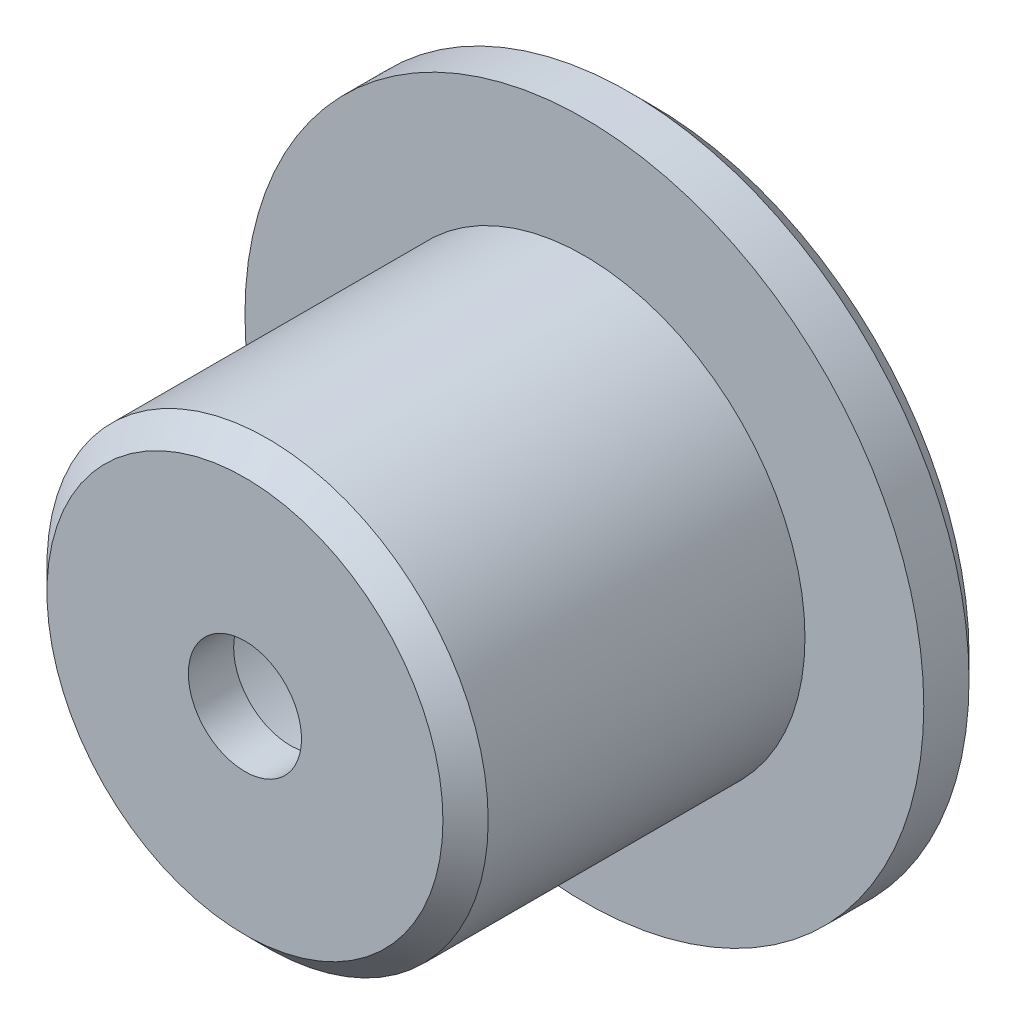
from build123d import *

# Parameters (mm, degrees)
SKETCH_1_R          = 15
EXTRUDE_1_DEPTH     = 3
SKETCH_2_R          = 9.75
EXTRUDE_2_DEPTH     = 15
SKETCH_3_R          = 7
CUT_EXTRUDE_1_DEPTH = 16
SKETCH_4_R          = 2.5
CUT_EXTRUDE_2_DEPTH = 14
CHAMFER_1_SIZE      = 1


with BuildPart() as part:
    # Sketch 1 → Extrude 1 (new body)
    with BuildSketch(Plane.XY):
        Circle(SKETCH_1_R)
    extrude(amount=EXTRUDE_1_DEPTH)

    # Sketch 2 → Extrude 2 (add)
    with BuildSketch(Plane.XY.offset(3)):
        Circle(SKETCH_2_R)
    extrude(amount=EXTRUDE_2_DEPTH)

    # Sketch 3 → Cut-Extrude 1 (cut)
    with BuildSketch(Plane(origin=(0, 0, 0), x_dir=(-1, 0, 0), z_dir=(0, 0, -1))):
        Circle(SKETCH_3_R)
    extrude(amount=-CUT_EXTRUDE_1_DEPTH, mode=Mode.SUBTRACT)

    # Sketch 4 → Cut-Extrude 2 (cut)
    with BuildSketch(Plane(origin=(0, 0, 16), x_dir=(-1, 0, 0), z_dir=(0, 0, -1))):
        Circle(SKETCH_4_R)
    extrude(amount=-CUT_EXTRUDE_2_DEPTH, mode=Mode.SUBTRACT)

    # Chamfer 1
    chamfer_1_edges = [part.edges().sort_by_distance(p)[0] for p in [
        (7, 0, 0),
        (-15, 0, 0),
        (-9.75, 0, 18),
    ]]
    chamfer(chamfer_1_edges, length=CHAMFER_1_SIZE)


solid = part.part
